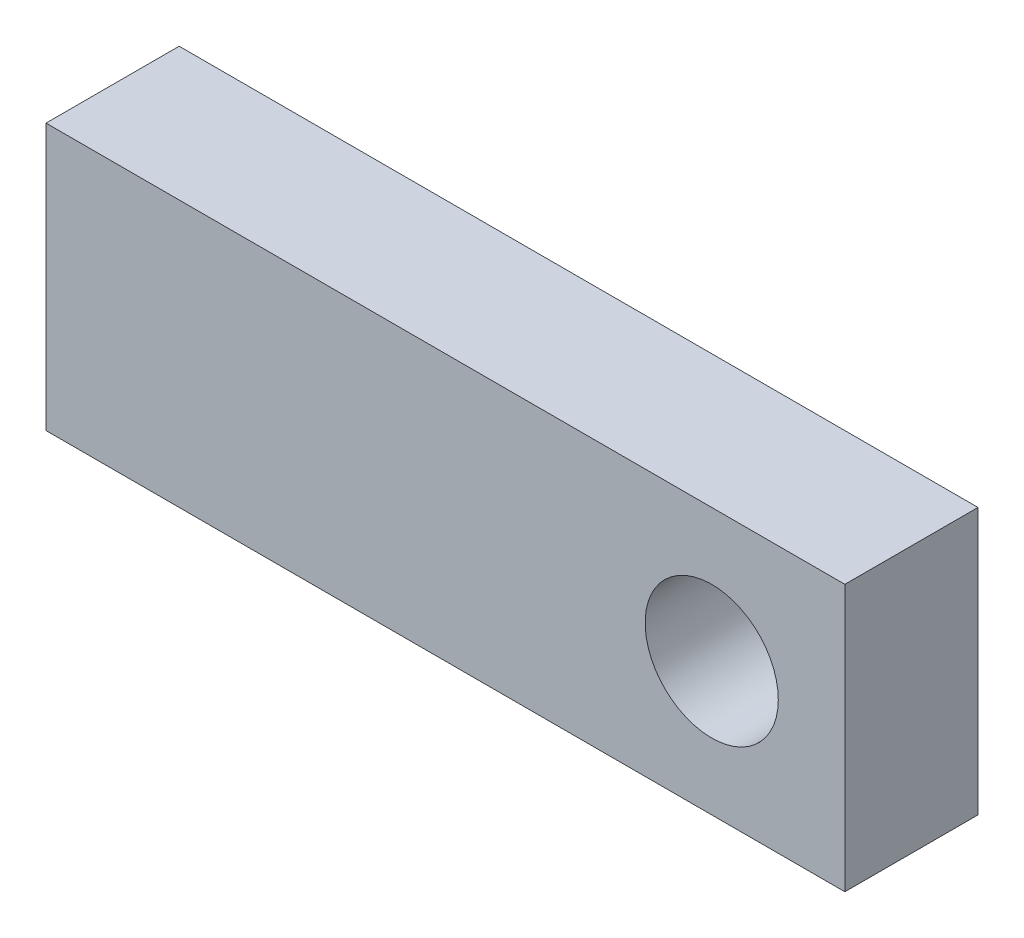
ISO-10303-21;
HEADER;
FILE_DESCRIPTION(('STEP AP214'),'2;1');
FILE_NAME('part.step','',(''),(''),'','','');
FILE_SCHEMA(('AUTOMOTIVE_DESIGN { 1 0 10303 214 1 1 1 1 }'));
ENDSEC;
DATA;
#1=APPLICATION_CONTEXT('core data for automotive mechanical design processes');
#2=APPLICATION_PROTOCOL_DEFINITION('international standard','automotive_design',2000,#1);
#3=PRODUCT_CONTEXT('',#1,'mechanical');
#4=PRODUCT('Part','Part','',(#3));
#5=PRODUCT_RELATED_PRODUCT_CATEGORY('part','',(#4));
#6=PRODUCT_DEFINITION_FORMATION('','',#4);
#7=PRODUCT_DEFINITION_CONTEXT('part definition',#1,'design');
#8=PRODUCT_DEFINITION('design','',#6,#7);
#9=PRODUCT_DEFINITION_SHAPE('','',#8);
#10=(LENGTH_UNIT() NAMED_UNIT(*) SI_UNIT(.MILLI.,.METRE.));
#11=(NAMED_UNIT(*) PLANE_ANGLE_UNIT() SI_UNIT($,.RADIAN.));
#12=(NAMED_UNIT(*) SI_UNIT($,.STERADIAN.) SOLID_ANGLE_UNIT());
#13=UNCERTAINTY_MEASURE_WITH_UNIT(LENGTH_MEASURE(1.E-05),#10,'distance_accuracy_value','');
#14=(GEOMETRIC_REPRESENTATION_CONTEXT(3) GLOBAL_UNCERTAINTY_ASSIGNED_CONTEXT((#13)) GLOBAL_UNIT_ASSIGNED_CONTEXT((#10,
#11,#12)) REPRESENTATION_CONTEXT('',''));
#15=CARTESIAN_POINT('',(0.,0.,0.));
#16=DIRECTION('',(0.,0.,1.));
#17=DIRECTION('',(1.,0.,0.));
#18=AXIS2_PLACEMENT_3D('',#15,#16,#17);
#19=CARTESIAN_POINT('',(-27.234339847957,-8.20939430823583,12.7));
#20=DIRECTION('',(0.,0.,1.));
#21=DIRECTION('',(1.,0.,0.));
#22=AXIS2_PLACEMENT_3D('',#19,#20,#21);
#23=PLANE('',#22);
#24=DIRECTION('',(0.,-1.,0.));
#25=VECTOR('',#24,1.);
#26=CARTESIAN_POINT('',(-27.234339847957,17.1906056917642,12.7));
#27=LINE('',#26,#25);
#28=CARTESIAN_POINT('',(-27.234339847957,17.1906056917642,12.7));
#29=VERTEX_POINT('',#28);
#30=CARTESIAN_POINT('',(-27.234339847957,-8.20939430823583,12.7));
#31=VERTEX_POINT('',#30);
#32=EDGE_CURVE('E82',#29,#31,#27,.T.);
#33=ORIENTED_EDGE('',*,*,#32,.T.);
#34=DIRECTION('',(1.,0.,0.));
#35=VECTOR('',#34,1.);
#36=CARTESIAN_POINT('',(-27.234339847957,-8.20939430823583,12.7));
#37=LINE('',#36,#35);
#38=CARTESIAN_POINT('',(48.965660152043,-8.20939430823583,12.7));
#39=VERTEX_POINT('',#38);
#40=EDGE_CURVE('E77',#31,#39,#37,.T.);
#41=ORIENTED_EDGE('',*,*,#40,.T.);
#42=DIRECTION('',(0.,1.,0.));
#43=VECTOR('',#42,1.);
#44=CARTESIAN_POINT('',(48.965660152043,17.1906056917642,12.7));
#45=LINE('',#44,#43);
#46=CARTESIAN_POINT('',(48.965660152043,17.1906056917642,12.7));
#47=VERTEX_POINT('',#46);
#48=EDGE_CURVE('E80',#39,#47,#45,.T.);
#49=ORIENTED_EDGE('',*,*,#48,.T.);
#50=DIRECTION('',(-1.,0.,0.));
#51=VECTOR('',#50,1.);
#52=CARTESIAN_POINT('',(-27.234339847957,17.1906056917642,12.7));
#53=LINE('',#52,#51);
#54=EDGE_CURVE('E47',#47,#29,#53,.T.);
#55=ORIENTED_EDGE('',*,*,#54,.T.);
#56=EDGE_LOOP('',(#33,#41,#49,#55));
#57=FACE_BOUND('',#56,.T.);
#58=CARTESIAN_POINT('',(36.265660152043,4.49060569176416,12.7));
#59=DIRECTION('',(0.,0.,1.));
#60=DIRECTION('',(1.,0.,0.));
#61=AXIS2_PLACEMENT_3D('',#58,#59,#60);
#62=CIRCLE('',#61,6.35);
#63=CARTESIAN_POINT('',(42.615660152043,4.49060569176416,12.7));
#64=VERTEX_POINT('',#63);
#65=EDGE_CURVE('E97',#64,#64,#62,.T.);
#66=ORIENTED_EDGE('',*,*,#65,.F.);
#67=EDGE_LOOP('',(#66));
#68=FACE_BOUND('',#67,.T.);
#69=ADVANCED_FACE('F30',(#57,#68),#23,.T.);
#70=CARTESIAN_POINT('',(-27.234339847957,-8.20939430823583,0.));
#71=DIRECTION('',(0.,0.,1.));
#72=DIRECTION('',(1.,0.,0.));
#73=AXIS2_PLACEMENT_3D('',#70,#71,#72);
#74=PLANE('',#73);
#75=DIRECTION('',(0.,-1.,0.));
#76=VECTOR('',#75,1.);
#77=CARTESIAN_POINT('',(-27.234339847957,17.1906056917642,0.));
#78=LINE('',#77,#76);
#79=CARTESIAN_POINT('',(-27.234339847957,17.1906056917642,0.));
#80=VERTEX_POINT('',#79);
#81=CARTESIAN_POINT('',(-27.234339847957,-8.20939430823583,0.));
#82=VERTEX_POINT('',#81);
#83=EDGE_CURVE('E94',#80,#82,#78,.T.);
#84=ORIENTED_EDGE('',*,*,#83,.F.);
#85=DIRECTION('',(-1.,0.,0.));
#86=VECTOR('',#85,1.);
#87=CARTESIAN_POINT('',(-27.234339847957,17.1906056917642,0.));
#88=LINE('',#87,#86);
#89=CARTESIAN_POINT('',(48.965660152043,17.1906056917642,0.));
#90=VERTEX_POINT('',#89);
#91=EDGE_CURVE('E70',#90,#80,#88,.T.);
#92=ORIENTED_EDGE('',*,*,#91,.F.);
#93=DIRECTION('',(0.,1.,0.));
#94=VECTOR('',#93,1.);
#95=CARTESIAN_POINT('',(48.965660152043,17.1906056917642,0.));
#96=LINE('',#95,#94);
#97=CARTESIAN_POINT('',(48.965660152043,-8.20939430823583,0.));
#98=VERTEX_POINT('',#97);
#99=EDGE_CURVE('E64',#98,#90,#96,.T.);
#100=ORIENTED_EDGE('',*,*,#99,.F.);
#101=DIRECTION('',(1.,0.,0.));
#102=VECTOR('',#101,1.);
#103=CARTESIAN_POINT('',(-27.234339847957,-8.20939430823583,0.));
#104=LINE('',#103,#102);
#105=EDGE_CURVE('E86',#82,#98,#104,.T.);
#106=ORIENTED_EDGE('',*,*,#105,.F.);
#107=EDGE_LOOP('',(#84,#92,#100,#106));
#108=FACE_BOUND('',#107,.T.);
#109=CARTESIAN_POINT('',(36.265660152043,4.49060569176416,0.));
#110=DIRECTION('',(0.,0.,1.));
#111=DIRECTION('',(1.,0.,0.));
#112=AXIS2_PLACEMENT_3D('',#109,#110,#111);
#113=CIRCLE('',#112,6.35);
#114=CARTESIAN_POINT('',(42.615660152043,4.49060569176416,0.));
#115=VERTEX_POINT('',#114);
#116=EDGE_CURVE('E109',#115,#115,#113,.T.);
#117=ORIENTED_EDGE('',*,*,#116,.T.);
#118=EDGE_LOOP('',(#117));
#119=FACE_BOUND('',#118,.T.);
#120=ADVANCED_FACE('F105',(#108,#119),#74,.F.);
#121=CARTESIAN_POINT('',(-27.234339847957,17.1906056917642,12.7));
#122=DIRECTION('',(1.,0.,0.));
#123=DIRECTION('',(0.,0.,-1.));
#124=AXIS2_PLACEMENT_3D('',#121,#122,#123);
#125=PLANE('',#124);
#126=ORIENTED_EDGE('',*,*,#83,.T.);
#127=DIRECTION('',(0.,0.,-1.));
#128=VECTOR('',#127,1.);
#129=CARTESIAN_POINT('',(-27.234339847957,-8.20939430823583,12.7));
#130=LINE('',#129,#128);
#131=EDGE_CURVE('E11',#31,#82,#130,.T.);
#132=ORIENTED_EDGE('',*,*,#131,.F.);
#133=ORIENTED_EDGE('',*,*,#32,.F.);
#134=DIRECTION('',(0.,0.,-1.));
#135=VECTOR('',#134,1.);
#136=CARTESIAN_POINT('',(-27.234339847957,17.1906056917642,12.7));
#137=LINE('',#136,#135);
#138=EDGE_CURVE('E90',#29,#80,#137,.T.);
#139=ORIENTED_EDGE('',*,*,#138,.T.);
#140=EDGE_LOOP('',(#126,#132,#133,#139));
#141=FACE_BOUND('',#140,.T.);
#142=ADVANCED_FACE('F32',(#141),#125,.F.);
#143=CARTESIAN_POINT('',(-27.234339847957,-8.20939430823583,12.7));
#144=DIRECTION('',(0.,1.,0.));
#145=DIRECTION('',(0.,0.,1.));
#146=AXIS2_PLACEMENT_3D('',#143,#144,#145);
#147=PLANE('',#146);
#148=ORIENTED_EDGE('',*,*,#105,.T.);
#149=DIRECTION('',(0.,0.,-1.));
#150=VECTOR('',#149,1.);
#151=CARTESIAN_POINT('',(48.965660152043,-8.20939430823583,12.7));
#152=LINE('',#151,#150);
#153=EDGE_CURVE('E39',#39,#98,#152,.T.);
#154=ORIENTED_EDGE('',*,*,#153,.F.);
#155=ORIENTED_EDGE('',*,*,#40,.F.);
#156=ORIENTED_EDGE('',*,*,#131,.T.);
#157=EDGE_LOOP('',(#148,#154,#155,#156));
#158=FACE_BOUND('',#157,.T.);
#159=ADVANCED_FACE('F85',(#158),#147,.F.);
#160=CARTESIAN_POINT('',(48.965660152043,17.1906056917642,12.7));
#161=DIRECTION('',(-1.,0.,0.));
#162=DIRECTION('',(0.,0.,1.));
#163=AXIS2_PLACEMENT_3D('',#160,#161,#162);
#164=PLANE('',#163);
#165=ORIENTED_EDGE('',*,*,#99,.T.);
#166=DIRECTION('',(0.,0.,-1.));
#167=VECTOR('',#166,1.);
#168=CARTESIAN_POINT('',(48.965660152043,17.1906056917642,12.7));
#169=LINE('',#168,#167);
#170=EDGE_CURVE('E87',#47,#90,#169,.T.);
#171=ORIENTED_EDGE('',*,*,#170,.F.);
#172=ORIENTED_EDGE('',*,*,#48,.F.);
#173=ORIENTED_EDGE('',*,*,#153,.T.);
#174=EDGE_LOOP('',(#165,#171,#172,#173));
#175=FACE_BOUND('',#174,.T.);
#176=ADVANCED_FACE('F88',(#175),#164,.F.);
#177=CARTESIAN_POINT('',(-27.234339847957,17.1906056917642,12.7));
#178=DIRECTION('',(0.,-1.,0.));
#179=DIRECTION('',(0.,0.,-1.));
#180=AXIS2_PLACEMENT_3D('',#177,#178,#179);
#181=PLANE('',#180);
#182=ORIENTED_EDGE('',*,*,#91,.T.);
#183=ORIENTED_EDGE('',*,*,#138,.F.);
#184=ORIENTED_EDGE('',*,*,#54,.F.);
#185=ORIENTED_EDGE('',*,*,#170,.T.);
#186=EDGE_LOOP('',(#182,#183,#184,#185));
#187=FACE_BOUND('',#186,.T.);
#188=ADVANCED_FACE('F102',(#187),#181,.F.);
#189=CARTESIAN_POINT('',(36.265660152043,4.49060569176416,12.7));
#190=DIRECTION('',(0.,0.,-1.));
#191=DIRECTION('',(-1.,0.,0.));
#192=AXIS2_PLACEMENT_3D('',#189,#190,#191);
#193=CYLINDRICAL_SURFACE('',#192,6.35);
#194=ORIENTED_EDGE('',*,*,#65,.T.);
#195=EDGE_LOOP('',(#194));
#196=FACE_BOUND('',#195,.T.);
#197=ORIENTED_EDGE('',*,*,#116,.F.);
#198=EDGE_LOOP('',(#197));
#199=FACE_BOUND('',#198,.T.);
#200=ADVANCED_FACE('F115',(#196,#199),#193,.F.);
#201=CLOSED_SHELL('',(#69,#120,#142,#159,#176,#188,#200));
#202=MANIFOLD_SOLID_BREP('B2',#201);
#203=ADVANCED_BREP_SHAPE_REPRESENTATION('',(#18,#202),#14);
#204=SHAPE_DEFINITION_REPRESENTATION(#9,#203);
ENDSEC;
END-ISO-10303-21;
